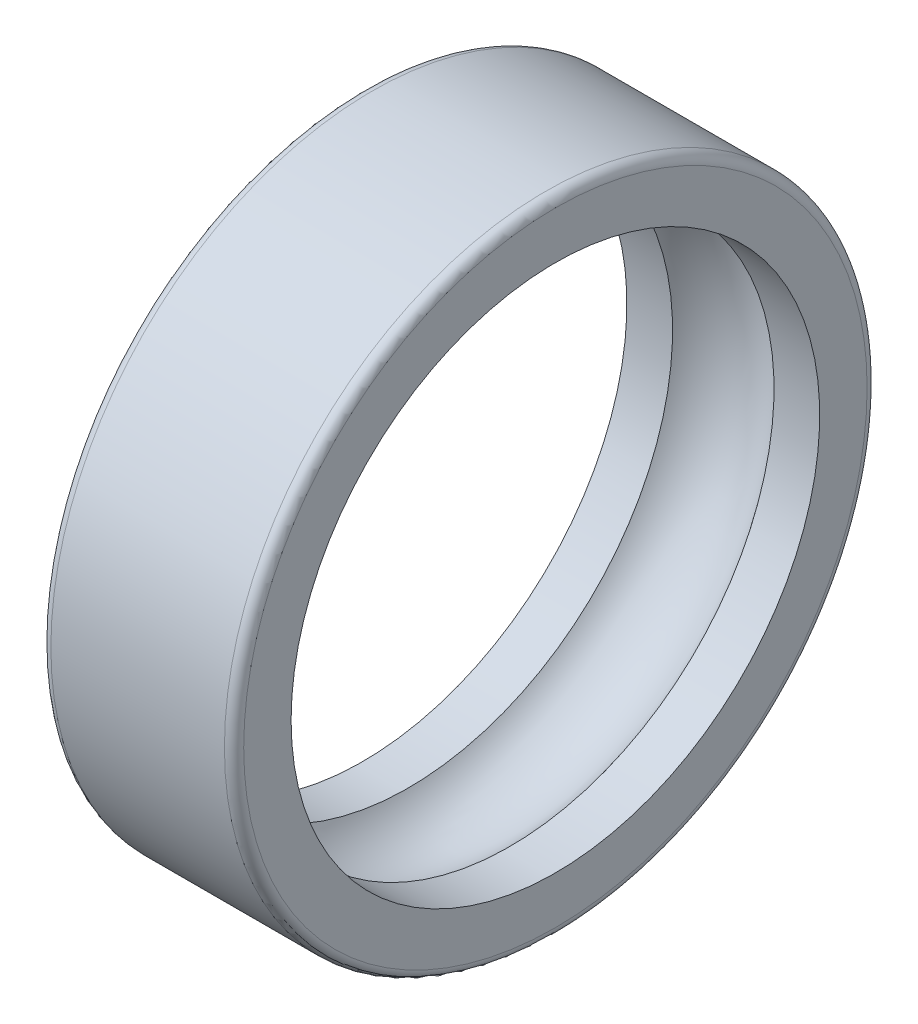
ISO-10303-21;
HEADER;
FILE_DESCRIPTION(('STEP AP214'),'2;1');
FILE_NAME('part.step','',(''),(''),'','','');
FILE_SCHEMA(('AUTOMOTIVE_DESIGN { 1 0 10303 214 1 1 1 1 }'));
ENDSEC;
DATA;
#1=APPLICATION_CONTEXT('core data for automotive mechanical design processes');
#2=APPLICATION_PROTOCOL_DEFINITION('international standard','automotive_design',2000,#1);
#3=PRODUCT_CONTEXT('',#1,'mechanical');
#4=PRODUCT('Part','Part','',(#3));
#5=PRODUCT_RELATED_PRODUCT_CATEGORY('part','',(#4));
#6=PRODUCT_DEFINITION_FORMATION('','',#4);
#7=PRODUCT_DEFINITION_CONTEXT('part definition',#1,'design');
#8=PRODUCT_DEFINITION('design','',#6,#7);
#9=PRODUCT_DEFINITION_SHAPE('','',#8);
#10=(LENGTH_UNIT() NAMED_UNIT(*) SI_UNIT(.MILLI.,.METRE.));
#11=(NAMED_UNIT(*) PLANE_ANGLE_UNIT() SI_UNIT($,.RADIAN.));
#12=(NAMED_UNIT(*) SI_UNIT($,.STERADIAN.) SOLID_ANGLE_UNIT());
#13=UNCERTAINTY_MEASURE_WITH_UNIT(LENGTH_MEASURE(1.E-05),#10,'distance_accuracy_value','');
#14=(GEOMETRIC_REPRESENTATION_CONTEXT(3) GLOBAL_UNCERTAINTY_ASSIGNED_CONTEXT((#13)) GLOBAL_UNIT_ASSIGNED_CONTEXT((#10,
#11,#12)) REPRESENTATION_CONTEXT('',''));
#15=CARTESIAN_POINT('',(0.,0.,0.));
#16=DIRECTION('',(0.,0.,1.));
#17=DIRECTION('',(1.,0.,0.));
#18=AXIS2_PLACEMENT_3D('',#15,#16,#17);
#19=CARTESIAN_POINT('',(0.,19.4,0.));
#20=DIRECTION('',(1.,0.,0.));
#21=DIRECTION('',(0.,0.,-1.));
#22=AXIS2_PLACEMENT_3D('',#19,#20,#21);
#23=PLANE('',#22);
#24=CARTESIAN_POINT('',(0.,0.,0.));
#25=DIRECTION('',(-1.,0.,0.));
#26=DIRECTION('',(0.,0.,1.));
#27=AXIS2_PLACEMENT_3D('',#24,#25,#26);
#28=CIRCLE('',#27,16.45);
#29=CARTESIAN_POINT('',(0.,0.,16.45));
#30=VERTEX_POINT('',#29);
#31=EDGE_CURVE('E10',#30,#30,#28,.T.);
#32=ORIENTED_EDGE('',*,*,#31,.F.);
#33=EDGE_LOOP('',(#32));
#34=FACE_BOUND('',#33,.T.);
#35=CARTESIAN_POINT('',(0.,0.,0.));
#36=DIRECTION('',(-1.,0.,0.));
#37=DIRECTION('',(0.,0.,1.));
#38=AXIS2_PLACEMENT_3D('',#35,#36,#37);
#39=CIRCLE('',#38,19.4);
#40=CARTESIAN_POINT('',(0.,0.,19.4));
#41=VERTEX_POINT('',#40);
#42=EDGE_CURVE('E42',#41,#41,#39,.T.);
#43=ORIENTED_EDGE('',*,*,#42,.T.);
#44=EDGE_LOOP('',(#43));
#45=FACE_BOUND('',#44,.T.);
#46=ADVANCED_FACE('F14',(#34,#45),#23,.F.);
#47=CARTESIAN_POINT('',(0.,0.,0.));
#48=DIRECTION('',(-1.,0.,0.));
#49=DIRECTION('',(0.,0.,1.));
#50=AXIS2_PLACEMENT_3D('',#47,#48,#49);
#51=CYLINDRICAL_SURFACE('',#50,16.45);
#52=CARTESIAN_POINT('',(2.84344817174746,0.,0.));
#53=DIRECTION('',(-1.,0.,0.));
#54=DIRECTION('',(0.,0.,1.));
#55=AXIS2_PLACEMENT_3D('',#52,#53,#54);
#56=CIRCLE('',#55,16.45);
#57=CARTESIAN_POINT('',(2.84344817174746,0.,16.45));
#58=VERTEX_POINT('',#57);
#59=EDGE_CURVE('E20',#58,#58,#56,.T.);
#60=ORIENTED_EDGE('',*,*,#59,.F.);
#61=EDGE_LOOP('',(#60));
#62=FACE_BOUND('',#61,.T.);
#63=ORIENTED_EDGE('',*,*,#31,.T.);
#64=EDGE_LOOP('',(#63));
#65=FACE_BOUND('',#64,.T.);
#66=ADVANCED_FACE('F79',(#62,#65),#51,.F.);
#67=CARTESIAN_POINT('',(6.,0.,0.));
#68=DIRECTION('',(-1.,0.,0.));
#69=DIRECTION('',(0.,0.,1.));
#70=AXIS2_PLACEMENT_3D('',#67,#68,#69);
#71=TOROIDAL_SURFACE('',#70,14.275,3.83333333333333);
#72=ORIENTED_EDGE('',*,*,#59,.T.);
#73=EDGE_LOOP('',(#72));
#74=FACE_BOUND('',#73,.T.);
#75=CARTESIAN_POINT('',(9.15655182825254,0.,0.));
#76=DIRECTION('',(-1.,0.,0.));
#77=DIRECTION('',(0.,0.,1.));
#78=AXIS2_PLACEMENT_3D('',#75,#76,#77);
#79=CIRCLE('',#78,16.45);
#80=CARTESIAN_POINT('',(9.15655182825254,0.,16.45));
#81=VERTEX_POINT('',#80);
#82=EDGE_CURVE('E24',#81,#81,#79,.T.);
#83=ORIENTED_EDGE('',*,*,#82,.F.);
#84=EDGE_LOOP('',(#83));
#85=FACE_BOUND('',#84,.T.);
#86=ADVANCED_FACE('F74',(#74,#85),#71,.F.);
#87=CARTESIAN_POINT('',(0.,0.,0.));
#88=DIRECTION('',(-1.,0.,0.));
#89=DIRECTION('',(0.,0.,1.));
#90=AXIS2_PLACEMENT_3D('',#87,#88,#89);
#91=CYLINDRICAL_SURFACE('',#90,16.45);
#92=CARTESIAN_POINT('',(12.,0.,0.));
#93=DIRECTION('',(-1.,0.,0.));
#94=DIRECTION('',(0.,0.,1.));
#95=AXIS2_PLACEMENT_3D('',#92,#93,#94);
#96=CIRCLE('',#95,16.45);
#97=CARTESIAN_POINT('',(12.,0.,16.45));
#98=VERTEX_POINT('',#97);
#99=EDGE_CURVE('E28',#98,#98,#96,.T.);
#100=ORIENTED_EDGE('',*,*,#99,.F.);
#101=EDGE_LOOP('',(#100));
#102=FACE_BOUND('',#101,.T.);
#103=ORIENTED_EDGE('',*,*,#82,.T.);
#104=EDGE_LOOP('',(#103));
#105=FACE_BOUND('',#104,.T.);
#106=ADVANCED_FACE('F68',(#102,#105),#91,.F.);
#107=CARTESIAN_POINT('',(12.,16.45,0.));
#108=DIRECTION('',(-1.,0.,0.));
#109=DIRECTION('',(0.,0.,1.));
#110=AXIS2_PLACEMENT_3D('',#107,#108,#109);
#111=PLANE('',#110);
#112=CARTESIAN_POINT('',(12.,0.,0.));
#113=DIRECTION('',(-1.,0.,0.));
#114=DIRECTION('',(0.,0.,1.));
#115=AXIS2_PLACEMENT_3D('',#112,#113,#114);
#116=CIRCLE('',#115,19.4);
#117=CARTESIAN_POINT('',(12.,0.,19.4));
#118=VERTEX_POINT('',#117);
#119=EDGE_CURVE('E33',#118,#118,#116,.T.);
#120=ORIENTED_EDGE('',*,*,#119,.F.);
#121=EDGE_LOOP('',(#120));
#122=FACE_BOUND('',#121,.T.);
#123=ORIENTED_EDGE('',*,*,#99,.T.);
#124=EDGE_LOOP('',(#123));
#125=FACE_BOUND('',#124,.T.);
#126=ADVANCED_FACE('F62',(#122,#125),#111,.F.);
#127=CARTESIAN_POINT('',(11.4,0.,0.));
#128=DIRECTION('',(-1.,0.,0.));
#129=DIRECTION('',(0.,0.,1.));
#130=AXIS2_PLACEMENT_3D('',#127,#128,#129);
#131=TOROIDAL_SURFACE('',#130,19.4,0.6);
#132=CARTESIAN_POINT('',(11.4,0.,0.));
#133=DIRECTION('',(-1.,0.,0.));
#134=DIRECTION('',(0.,0.,1.));
#135=AXIS2_PLACEMENT_3D('',#132,#133,#134);
#136=CIRCLE('',#135,20.);
#137=CARTESIAN_POINT('',(11.4,0.,20.));
#138=VERTEX_POINT('',#137);
#139=EDGE_CURVE('E36',#138,#138,#136,.T.);
#140=ORIENTED_EDGE('',*,*,#139,.F.);
#141=EDGE_LOOP('',(#140));
#142=FACE_BOUND('',#141,.T.);
#143=ORIENTED_EDGE('',*,*,#119,.T.);
#144=EDGE_LOOP('',(#143));
#145=FACE_BOUND('',#144,.T.);
#146=ADVANCED_FACE('F56',(#142,#145),#131,.T.);
#147=CARTESIAN_POINT('',(0.,0.,0.));
#148=DIRECTION('',(-1.,0.,0.));
#149=DIRECTION('',(0.,0.,1.));
#150=AXIS2_PLACEMENT_3D('',#147,#148,#149);
#151=CYLINDRICAL_SURFACE('',#150,20.);
#152=CARTESIAN_POINT('',(0.6,0.,0.));
#153=DIRECTION('',(-1.,0.,0.));
#154=DIRECTION('',(0.,0.,1.));
#155=AXIS2_PLACEMENT_3D('',#152,#153,#154);
#156=CIRCLE('',#155,20.);
#157=CARTESIAN_POINT('',(0.6,0.,20.));
#158=VERTEX_POINT('',#157);
#159=EDGE_CURVE('E39',#158,#158,#156,.T.);
#160=ORIENTED_EDGE('',*,*,#159,.F.);
#161=EDGE_LOOP('',(#160));
#162=FACE_BOUND('',#161,.T.);
#163=ORIENTED_EDGE('',*,*,#139,.T.);
#164=EDGE_LOOP('',(#163));
#165=FACE_BOUND('',#164,.T.);
#166=ADVANCED_FACE('F50',(#162,#165),#151,.T.);
#167=CARTESIAN_POINT('',(0.6,0.,0.));
#168=DIRECTION('',(-1.,0.,0.));
#169=DIRECTION('',(0.,0.,1.));
#170=AXIS2_PLACEMENT_3D('',#167,#168,#169);
#171=TOROIDAL_SURFACE('',#170,19.4,0.6);
#172=ORIENTED_EDGE('',*,*,#42,.F.);
#173=EDGE_LOOP('',(#172));
#174=FACE_BOUND('',#173,.T.);
#175=ORIENTED_EDGE('',*,*,#159,.T.);
#176=EDGE_LOOP('',(#175));
#177=FACE_BOUND('',#176,.T.);
#178=ADVANCED_FACE('F47',(#174,#177),#171,.T.);
#179=CLOSED_SHELL('',(#46,#66,#86,#106,#126,#146,#166,#178));
#180=MANIFOLD_SOLID_BREP('B1',#179);
#181=ADVANCED_BREP_SHAPE_REPRESENTATION('',(#18,#180),#14);
#182=SHAPE_DEFINITION_REPRESENTATION(#9,#181);
ENDSEC;
END-ISO-10303-21;
